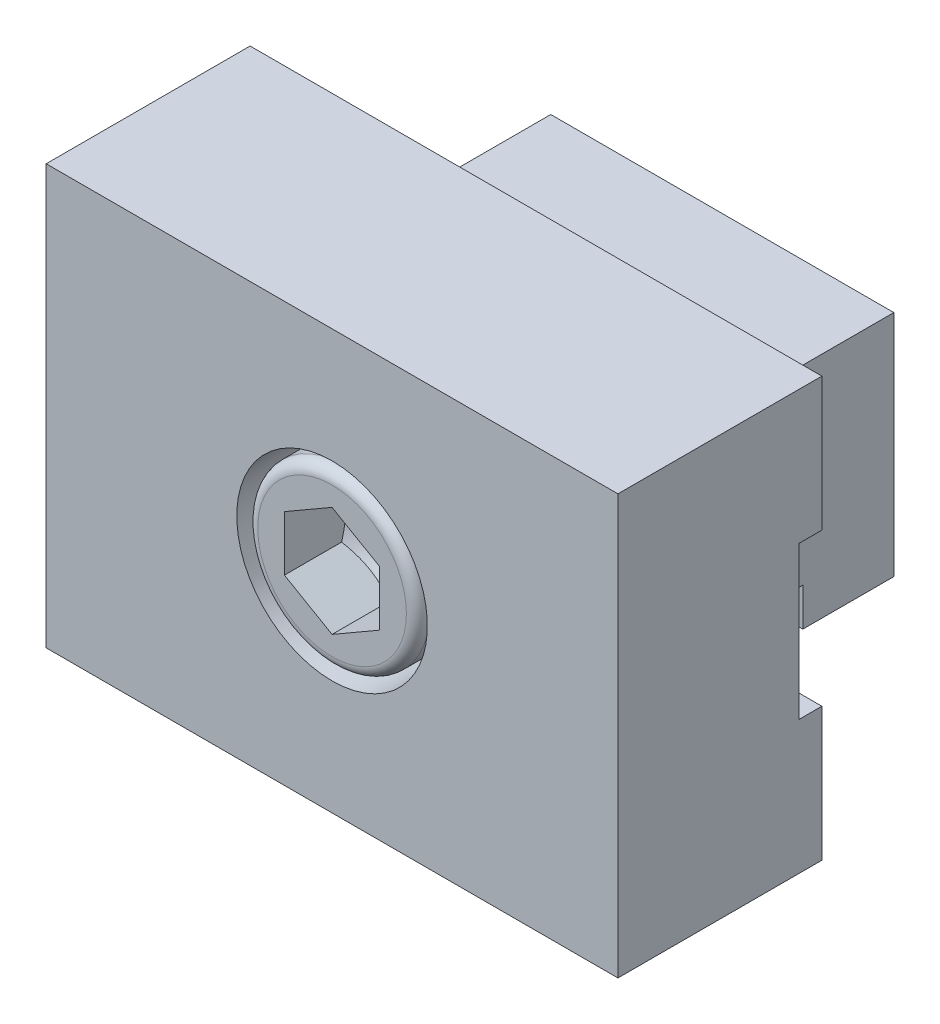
ISO-10303-21;
HEADER;
FILE_DESCRIPTION(('STEP AP214'),'2;1');
FILE_NAME('part.step','',(''),(''),'','','');
FILE_SCHEMA(('AUTOMOTIVE_DESIGN { 1 0 10303 214 1 1 1 1 }'));
ENDSEC;
DATA;
#1=APPLICATION_CONTEXT('core data for automotive mechanical design processes');
#2=APPLICATION_PROTOCOL_DEFINITION('international standard','automotive_design',2000,#1);
#3=PRODUCT_CONTEXT('',#1,'mechanical');
#4=PRODUCT('Part','Part','',(#3));
#5=PRODUCT_RELATED_PRODUCT_CATEGORY('part','',(#4));
#6=PRODUCT_DEFINITION_FORMATION('','',#4);
#7=PRODUCT_DEFINITION_CONTEXT('part definition',#1,'design');
#8=PRODUCT_DEFINITION('design','',#6,#7);
#9=PRODUCT_DEFINITION_SHAPE('','',#8);
#10=(LENGTH_UNIT() NAMED_UNIT(*) SI_UNIT(.MILLI.,.METRE.));
#11=(NAMED_UNIT(*) PLANE_ANGLE_UNIT() SI_UNIT($,.RADIAN.));
#12=(NAMED_UNIT(*) SI_UNIT($,.STERADIAN.) SOLID_ANGLE_UNIT());
#13=UNCERTAINTY_MEASURE_WITH_UNIT(LENGTH_MEASURE(1.E-05),#10,'distance_accuracy_value','');
#14=(GEOMETRIC_REPRESENTATION_CONTEXT(3) GLOBAL_UNCERTAINTY_ASSIGNED_CONTEXT((#13)) GLOBAL_UNIT_ASSIGNED_CONTEXT((#10,
#11,#12)) REPRESENTATION_CONTEXT('',''));
#15=CARTESIAN_POINT('',(0.,0.,0.));
#16=DIRECTION('',(0.,0.,1.));
#17=DIRECTION('',(1.,0.,0.));
#18=AXIS2_PLACEMENT_3D('',#15,#16,#17);
#19=CARTESIAN_POINT('',(0.,0.,-7.7875));
#20=DIRECTION('',(0.,0.,-1.));
#21=DIRECTION('',(-0.5,-0.866025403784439,0.));
#22=AXIS2_PLACEMENT_3D('',#19,#20,#21);
#23=CYLINDRICAL_SURFACE('',#22,6.);
#24=CARTESIAN_POINT('',(0.,0.,2.00000000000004));
#25=DIRECTION('',(0.,0.,1.));
#26=DIRECTION('',(0.,-1.,0.));
#27=AXIS2_PLACEMENT_3D('',#24,#25,#26);
#28=CIRCLE('',#27,6.);
#29=CARTESIAN_POINT('',(0.,-6.,2.00000000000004));
#30=VERTEX_POINT('',#29);
#31=EDGE_CURVE('E410',#30,#30,#28,.T.);
#32=ORIENTED_EDGE('',*,*,#31,.T.);
#33=EDGE_LOOP('',(#32));
#34=FACE_BOUND('',#33,.T.);
#35=CARTESIAN_POINT('',(0.,0.,2.4));
#36=DIRECTION('',(0.,0.,1.));
#37=DIRECTION('',(1.,0.,0.));
#38=AXIS2_PLACEMENT_3D('',#35,#36,#37);
#39=CIRCLE('',#38,6.);
#40=CARTESIAN_POINT('',(6.,0.,2.4));
#41=VERTEX_POINT('',#40);
#42=EDGE_CURVE('E19',#41,#41,#39,.F.);
#43=ORIENTED_EDGE('',*,*,#42,.T.);
#44=EDGE_LOOP('',(#43));
#45=FACE_BOUND('',#44,.T.);
#46=ADVANCED_FACE('F15',(#34,#45),#23,.T.);
#47=CARTESIAN_POINT('',(-18.,8.,-10.));
#48=DIRECTION('',(0.,1.,0.));
#49=DIRECTION('',(0.,0.,1.));
#50=AXIS2_PLACEMENT_3D('',#47,#48,#49);
#51=PLANE('',#50);
#52=DIRECTION('',(0.,0.,-1.));
#53=VECTOR('',#52,1.);
#54=CARTESIAN_POINT('',(-18.,8.,-9.49031612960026));
#55=LINE('',#54,#53);
#56=CARTESIAN_POINT('',(-18.,8.,0.));
#57=VERTEX_POINT('',#56);
#58=CARTESIAN_POINT('',(-18.,8.,-10.));
#59=VERTEX_POINT('',#58);
#60=EDGE_CURVE('E770',#57,#59,#55,.T.);
#61=ORIENTED_EDGE('',*,*,#60,.F.);
#62=DIRECTION('',(1.,0.,0.));
#63=VECTOR('',#62,1.);
#64=CARTESIAN_POINT('',(-20.,8.,0.));
#65=LINE('',#64,#63);
#66=CARTESIAN_POINT('',(18.,8.,0.));
#67=VERTEX_POINT('',#66);
#68=EDGE_CURVE('E26',#57,#67,#65,.T.);
#69=ORIENTED_EDGE('',*,*,#68,.T.);
#70=DIRECTION('',(0.,0.,1.));
#71=VECTOR('',#70,1.);
#72=CARTESIAN_POINT('',(18.,8.,-9.49031612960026));
#73=LINE('',#72,#71);
#74=CARTESIAN_POINT('',(18.,8.,-10.));
#75=VERTEX_POINT('',#74);
#76=EDGE_CURVE('E521',#75,#67,#73,.T.);
#77=ORIENTED_EDGE('',*,*,#76,.F.);
#78=DIRECTION('',(1.,0.,0.));
#79=VECTOR('',#78,1.);
#80=CARTESIAN_POINT('',(-18.,8.,-10.));
#81=LINE('',#80,#79);
#82=EDGE_CURVE('E550',#59,#75,#81,.T.);
#83=ORIENTED_EDGE('',*,*,#82,.F.);
#84=EDGE_LOOP('',(#61,#69,#77,#83));
#85=FACE_BOUND('',#84,.T.);
#86=ADVANCED_FACE('F268',(#85),#51,.T.);
#87=CARTESIAN_POINT('',(-18.,-8.,-10.));
#88=DIRECTION('',(0.,1.,0.));
#89=DIRECTION('',(0.,0.,1.));
#90=AXIS2_PLACEMENT_3D('',#87,#88,#89);
#91=PLANE('',#90);
#92=DIRECTION('',(0.,0.,1.));
#93=VECTOR('',#92,1.);
#94=CARTESIAN_POINT('',(18.,-8.,-9.49031612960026));
#95=LINE('',#94,#93);
#96=CARTESIAN_POINT('',(18.,-8.,0.));
#97=VERTEX_POINT('',#96);
#98=CARTESIAN_POINT('',(18.,-8.,-10.));
#99=VERTEX_POINT('',#98);
#100=EDGE_CURVE('E536',#97,#99,#95,.F.);
#101=ORIENTED_EDGE('',*,*,#100,.F.);
#102=DIRECTION('',(1.,0.,0.));
#103=VECTOR('',#102,1.);
#104=CARTESIAN_POINT('',(-20.,-8.,0.));
#105=LINE('',#104,#103);
#106=CARTESIAN_POINT('',(-18.,-8.,0.));
#107=VERTEX_POINT('',#106);
#108=EDGE_CURVE('E9',#97,#107,#105,.F.);
#109=ORIENTED_EDGE('',*,*,#108,.T.);
#110=DIRECTION('',(0.,0.,-1.));
#111=VECTOR('',#110,1.);
#112=CARTESIAN_POINT('',(-18.,-8.,-9.49031612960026));
#113=LINE('',#112,#111);
#114=CARTESIAN_POINT('',(-18.,-8.,-10.));
#115=VERTEX_POINT('',#114);
#116=EDGE_CURVE('E762',#115,#107,#113,.F.);
#117=ORIENTED_EDGE('',*,*,#116,.F.);
#118=DIRECTION('',(1.,0.,0.));
#119=VECTOR('',#118,1.);
#120=CARTESIAN_POINT('',(-18.,-8.,-10.));
#121=LINE('',#120,#119);
#122=EDGE_CURVE('E554',#99,#115,#121,.F.);
#123=ORIENTED_EDGE('',*,*,#122,.F.);
#124=EDGE_LOOP('',(#101,#109,#117,#123));
#125=FACE_BOUND('',#124,.T.);
#126=ADVANCED_FACE('F274',(#125),#91,.F.);
#127=CARTESIAN_POINT('',(-18.,-12.,-10.));
#128=DIRECTION('',(0.,0.,-1.));
#129=DIRECTION('',(0.,1.,0.));
#130=AXIS2_PLACEMENT_3D('',#127,#128,#129);
#131=PLANE('',#130);
#132=DIRECTION('',(1.,0.,0.));
#133=VECTOR('',#132,1.);
#134=CARTESIAN_POINT('',(-18.,-12.,-10.));
#135=LINE('',#134,#133);
#136=CARTESIAN_POINT('',(-18.,-12.,-10.));
#137=VERTEX_POINT('',#136);
#138=CARTESIAN_POINT('',(18.,-12.,-10.));
#139=VERTEX_POINT('',#138);
#140=EDGE_CURVE('E745',#137,#139,#135,.T.);
#141=ORIENTED_EDGE('',*,*,#140,.T.);
#142=DIRECTION('',(0.,-1.,0.));
#143=VECTOR('',#142,1.);
#144=CARTESIAN_POINT('',(18.,5.28464825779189,-10.));
#145=LINE('',#144,#143);
#146=EDGE_CURVE('E741',#99,#139,#145,.T.);
#147=ORIENTED_EDGE('',*,*,#146,.F.);
#148=ORIENTED_EDGE('',*,*,#122,.T.);
#149=DIRECTION('',(0.,-1.,0.));
#150=VECTOR('',#149,1.);
#151=CARTESIAN_POINT('',(-18.,5.28464825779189,-10.));
#152=LINE('',#151,#150);
#153=EDGE_CURVE('E757',#137,#115,#152,.F.);
#154=ORIENTED_EDGE('',*,*,#153,.F.);
#155=EDGE_LOOP('',(#141,#147,#148,#154));
#156=FACE_BOUND('',#155,.T.);
#157=ADVANCED_FACE('F281',(#156),#131,.F.);
#158=CARTESIAN_POINT('',(-18.,-12.,-19.5499287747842));
#159=DIRECTION('',(0.,1.,0.));
#160=DIRECTION('',(0.,0.,1.));
#161=AXIS2_PLACEMENT_3D('',#158,#159,#160);
#162=PLANE('',#161);
#163=DIRECTION('',(1.,0.,0.));
#164=VECTOR('',#163,1.);
#165=CARTESIAN_POINT('',(-18.,-12.,-19.5499287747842));
#166=LINE('',#165,#164);
#167=CARTESIAN_POINT('',(18.,-12.,-19.5499287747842));
#168=VERTEX_POINT('',#167);
#169=CARTESIAN_POINT('',(-18.,-12.,-19.5499287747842));
#170=VERTEX_POINT('',#169);
#171=EDGE_CURVE('E795',#168,#170,#166,.F.);
#172=ORIENTED_EDGE('',*,*,#171,.F.);
#173=DIRECTION('',(0.,0.,1.));
#174=VECTOR('',#173,1.);
#175=CARTESIAN_POINT('',(18.,-12.,-19.5499287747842));
#176=LINE('',#175,#174);
#177=EDGE_CURVE('E749',#139,#168,#176,.F.);
#178=ORIENTED_EDGE('',*,*,#177,.F.);
#179=ORIENTED_EDGE('',*,*,#140,.F.);
#180=DIRECTION('',(0.,0.,-1.));
#181=VECTOR('',#180,1.);
#182=CARTESIAN_POINT('',(-18.,-12.,-9.49031612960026));
#183=LINE('',#182,#181);
#184=EDGE_CURVE('E753',#170,#137,#183,.F.);
#185=ORIENTED_EDGE('',*,*,#184,.F.);
#186=EDGE_LOOP('',(#172,#178,#179,#185));
#187=FACE_BOUND('',#186,.T.);
#188=ADVANCED_FACE('F827',(#187),#162,.F.);
#189=CARTESIAN_POINT('',(-18.,0.,-19.5499287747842));
#190=DIRECTION('',(0.,0.,-1.));
#191=DIRECTION('',(0.,1.,0.));
#192=AXIS2_PLACEMENT_3D('',#189,#190,#191);
#193=PLANE('',#192);
#194=CARTESIAN_POINT('',(0.,0.,-19.5499287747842));
#195=DIRECTION('',(0.,0.,1.));
#196=DIRECTION('',(0.,-1.,0.));
#197=AXIS2_PLACEMENT_3D('',#194,#195,#196);
#198=CIRCLE('',#197,6.);
#199=CARTESIAN_POINT('',(0.,-6.,-19.5499287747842));
#200=VERTEX_POINT('',#199);
#201=EDGE_CURVE('E558',#200,#200,#198,.T.);
#202=ORIENTED_EDGE('',*,*,#201,.T.);
#203=EDGE_LOOP('',(#202));
#204=FACE_BOUND('',#203,.T.);
#205=DIRECTION('',(0.,1.,0.));
#206=VECTOR('',#205,1.);
#207=CARTESIAN_POINT('',(-18.,0.,-19.5499287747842));
#208=LINE('',#207,#206);
#209=CARTESIAN_POINT('',(-18.,12.,-19.5499287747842));
#210=VERTEX_POINT('',#209);
#211=EDGE_CURVE('E799',#170,#210,#208,.T.);
#212=ORIENTED_EDGE('',*,*,#211,.T.);
#213=DIRECTION('',(1.,0.,0.));
#214=VECTOR('',#213,1.);
#215=CARTESIAN_POINT('',(-18.,12.,-19.5499287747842));
#216=LINE('',#215,#214);
#217=CARTESIAN_POINT('',(18.,12.,-19.5499287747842));
#218=VERTEX_POINT('',#217);
#219=EDGE_CURVE('E562',#210,#218,#216,.T.);
#220=ORIENTED_EDGE('',*,*,#219,.T.);
#221=DIRECTION('',(0.,1.,0.));
#222=VECTOR('',#221,1.);
#223=CARTESIAN_POINT('',(18.,0.,-19.5499287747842));
#224=LINE('',#223,#222);
#225=EDGE_CURVE('E791',#218,#168,#224,.F.);
#226=ORIENTED_EDGE('',*,*,#225,.T.);
#227=ORIENTED_EDGE('',*,*,#171,.T.);
#228=EDGE_LOOP('',(#212,#220,#226,#227));
#229=FACE_BOUND('',#228,.T.);
#230=ADVANCED_FACE('F812',(#204,#229),#193,.T.);
#231=CARTESIAN_POINT('',(0.,0.,-19.5499287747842));
#232=DIRECTION('',(0.,0.,1.));
#233=DIRECTION('',(0.,-1.,0.));
#234=AXIS2_PLACEMENT_3D('',#231,#232,#233);
#235=CYLINDRICAL_SURFACE('',#234,6.);
#236=CARTESIAN_POINT('',(0.,0.,-19.5264625));
#237=DIRECTION('',(0.,0.,-1.));
#238=DIRECTION('',(-0.5,-0.866025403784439,0.));
#239=AXIS2_PLACEMENT_3D('',#236,#237,#238);
#240=CIRCLE('',#239,6.);
#241=CARTESIAN_POINT('',(-3.,-5.19615242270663,-19.5264625));
#242=VERTEX_POINT('',#241);
#243=EDGE_CURVE('E559',#242,#242,#240,.F.);
#244=ORIENTED_EDGE('',*,*,#243,.T.);
#245=EDGE_LOOP('',(#244));
#246=FACE_BOUND('',#245,.T.);
#247=ORIENTED_EDGE('',*,*,#201,.F.);
#248=EDGE_LOOP('',(#247));
#249=FACE_BOUND('',#248,.T.);
#250=ADVANCED_FACE('F815',(#246,#249),#235,.F.);
#251=CARTESIAN_POINT('',(-18.,12.,-19.5499287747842));
#252=DIRECTION('',(0.,1.,0.));
#253=DIRECTION('',(0.,0.,1.));
#254=AXIS2_PLACEMENT_3D('',#251,#252,#253);
#255=PLANE('',#254);
#256=DIRECTION('',(0.,0.,1.));
#257=VECTOR('',#256,1.);
#258=CARTESIAN_POINT('',(18.,12.,-19.5499287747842));
#259=LINE('',#258,#257);
#260=CARTESIAN_POINT('',(18.,12.,-10.));
#261=VERTEX_POINT('',#260);
#262=EDGE_CURVE('E787',#261,#218,#259,.F.);
#263=ORIENTED_EDGE('',*,*,#262,.T.);
#264=ORIENTED_EDGE('',*,*,#219,.F.);
#265=DIRECTION('',(0.,0.,1.));
#266=VECTOR('',#265,1.);
#267=CARTESIAN_POINT('',(-18.,12.,-19.5499287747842));
#268=LINE('',#267,#266);
#269=CARTESIAN_POINT('',(-18.,12.,-10.));
#270=VERTEX_POINT('',#269);
#271=EDGE_CURVE('E779',#210,#270,#268,.T.);
#272=ORIENTED_EDGE('',*,*,#271,.T.);
#273=DIRECTION('',(1.,0.,0.));
#274=VECTOR('',#273,1.);
#275=CARTESIAN_POINT('',(-18.,12.,-10.));
#276=LINE('',#275,#274);
#277=EDGE_CURVE('E783',#270,#261,#276,.T.);
#278=ORIENTED_EDGE('',*,*,#277,.T.);
#279=EDGE_LOOP('',(#263,#264,#272,#278));
#280=FACE_BOUND('',#279,.T.);
#281=ADVANCED_FACE('F817',(#280),#255,.T.);
#282=CARTESIAN_POINT('',(-18.,12.,-10.));
#283=DIRECTION('',(0.,0.,1.));
#284=DIRECTION('',(0.,-1.,0.));
#285=AXIS2_PLACEMENT_3D('',#282,#283,#284);
#286=PLANE('',#285);
#287=DIRECTION('',(0.,-1.,0.));
#288=VECTOR('',#287,1.);
#289=CARTESIAN_POINT('',(18.,5.28464825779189,-10.));
#290=LINE('',#289,#288);
#291=EDGE_CURVE('E529',#261,#75,#290,.T.);
#292=ORIENTED_EDGE('',*,*,#291,.F.);
#293=ORIENTED_EDGE('',*,*,#277,.F.);
#294=DIRECTION('',(0.,-1.,0.));
#295=VECTOR('',#294,1.);
#296=CARTESIAN_POINT('',(-18.,5.28464825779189,-10.));
#297=LINE('',#296,#295);
#298=EDGE_CURVE('E775',#59,#270,#297,.F.);
#299=ORIENTED_EDGE('',*,*,#298,.F.);
#300=ORIENTED_EDGE('',*,*,#82,.T.);
#301=EDGE_LOOP('',(#292,#293,#299,#300));
#302=FACE_BOUND('',#301,.T.);
#303=ADVANCED_FACE('F824',(#302),#286,.T.);
#304=CARTESIAN_POINT('',(18.,5.28464825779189,-9.49031612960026));
#305=DIRECTION('',(1.,0.,0.));
#306=DIRECTION('',(0.,0.,1.));
#307=AXIS2_PLACEMENT_3D('',#304,#305,#306);
#308=PLANE('',#307);
#309=ORIENTED_EDGE('',*,*,#146,.T.);
#310=ORIENTED_EDGE('',*,*,#177,.T.);
#311=ORIENTED_EDGE('',*,*,#225,.F.);
#312=ORIENTED_EDGE('',*,*,#262,.F.);
#313=ORIENTED_EDGE('',*,*,#291,.T.);
#314=ORIENTED_EDGE('',*,*,#76,.T.);
#315=CARTESIAN_POINT('',(18.,8.,2.00000000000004));
#316=VERTEX_POINT('',#315);
#317=EDGE_CURVE('E525',#67,#316,#73,.T.);
#318=ORIENTED_EDGE('',*,*,#317,.T.);
#319=DIRECTION('',(0.,-1.,0.));
#320=VECTOR('',#319,1.);
#321=CARTESIAN_POINT('',(18.,5.28464825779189,2.00000000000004));
#322=LINE('',#321,#320);
#323=CARTESIAN_POINT('',(18.,-8.,2.00000000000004));
#324=VERTEX_POINT('',#323);
#325=EDGE_CURVE('E532',#316,#324,#322,.T.);
#326=ORIENTED_EDGE('',*,*,#325,.T.);
#327=EDGE_CURVE('E37',#324,#97,#95,.F.);
#328=ORIENTED_EDGE('',*,*,#327,.T.);
#329=ORIENTED_EDGE('',*,*,#100,.T.);
#330=EDGE_LOOP('',(#309,#310,#311,#312,#313,#314,#318,#326,#328,#329));
#331=FACE_BOUND('',#330,.T.);
#332=ADVANCED_FACE('F523',(#331),#308,.T.);
#333=CARTESIAN_POINT('',(-18.,5.28464825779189,-9.49031612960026));
#334=DIRECTION('',(-1.,0.,0.));
#335=DIRECTION('',(0.,0.,-1.));
#336=AXIS2_PLACEMENT_3D('',#333,#334,#335);
#337=PLANE('',#336);
#338=ORIENTED_EDGE('',*,*,#298,.T.);
#339=ORIENTED_EDGE('',*,*,#271,.F.);
#340=ORIENTED_EDGE('',*,*,#211,.F.);
#341=ORIENTED_EDGE('',*,*,#184,.T.);
#342=ORIENTED_EDGE('',*,*,#153,.T.);
#343=ORIENTED_EDGE('',*,*,#116,.T.);
#344=CARTESIAN_POINT('',(-18.,-8.,2.00000000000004));
#345=VERTEX_POINT('',#344);
#346=EDGE_CURVE('E761',#107,#345,#113,.F.);
#347=ORIENTED_EDGE('',*,*,#346,.T.);
#348=DIRECTION('',(0.,-1.,0.));
#349=VECTOR('',#348,1.);
#350=CARTESIAN_POINT('',(-18.,5.28464825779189,2.00000000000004));
#351=LINE('',#350,#349);
#352=CARTESIAN_POINT('',(-18.,8.,2.00000000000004));
#353=VERTEX_POINT('',#352);
#354=EDGE_CURVE('E766',#345,#353,#351,.F.);
#355=ORIENTED_EDGE('',*,*,#354,.T.);
#356=EDGE_CURVE('E771',#353,#57,#55,.T.);
#357=ORIENTED_EDGE('',*,*,#356,.T.);
#358=ORIENTED_EDGE('',*,*,#60,.T.);
#359=EDGE_LOOP('',(#338,#339,#340,#341,#342,#343,#347,#355,#357,#358));
#360=FACE_BOUND('',#359,.T.);
#361=ADVANCED_FACE('F830',(#360),#337,.T.);
#362=CARTESIAN_POINT('',(-18.,8.,2.00000000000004));
#363=DIRECTION('',(0.,0.,1.));
#364=DIRECTION('',(0.,-1.,0.));
#365=AXIS2_PLACEMENT_3D('',#362,#363,#364);
#366=PLANE('',#365);
#367=ORIENTED_EDGE('',*,*,#31,.F.);
#368=EDGE_LOOP('',(#367));
#369=FACE_BOUND('',#368,.T.);
#370=ORIENTED_EDGE('',*,*,#354,.F.);
#371=DIRECTION('',(1.,0.,0.));
#372=VECTOR('',#371,1.);
#373=CARTESIAN_POINT('',(-18.,-8.,2.00000000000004));
#374=LINE('',#373,#372);
#375=EDGE_CURVE('E542',#345,#324,#374,.T.);
#376=ORIENTED_EDGE('',*,*,#375,.T.);
#377=ORIENTED_EDGE('',*,*,#325,.F.);
#378=DIRECTION('',(1.,0.,0.));
#379=VECTOR('',#378,1.);
#380=CARTESIAN_POINT('',(-18.,8.,2.00000000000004));
#381=LINE('',#380,#379);
#382=EDGE_CURVE('E546',#316,#353,#381,.F.);
#383=ORIENTED_EDGE('',*,*,#382,.T.);
#384=EDGE_LOOP('',(#370,#376,#377,#383));
#385=FACE_BOUND('',#384,.T.);
#386=ADVANCED_FACE('F291',(#369,#385),#366,.T.);
#387=CARTESIAN_POINT('',(-1.5,-2.59807621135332,-20.6));
#388=DIRECTION('',(0.,0.,-1.));
#389=DIRECTION('',(-0.5,-0.866025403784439,0.));
#390=AXIS2_PLACEMENT_3D('',#387,#388,#389);
#391=PLANE('',#390);
#392=CARTESIAN_POINT('',(0.,0.,-20.6000000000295));
#393=DIRECTION('',(0.,0.,1.));
#394=DIRECTION('',(-0.866025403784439,0.5,0.));
#395=AXIS2_PLACEMENT_3D('',#392,#393,#394);
#396=CIRCLE('',#395,4.92646249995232);
#397=CARTESIAN_POINT('',(-4.2664416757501,2.46323124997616,-20.6000000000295));
#398=VERTEX_POINT('',#397);
#399=EDGE_CURVE('E406',#398,#398,#396,.T.);
#400=ORIENTED_EDGE('',*,*,#399,.F.);
#401=EDGE_LOOP('',(#400));
#402=FACE_BOUND('',#401,.T.);
#403=ADVANCED_FACE('F287',(#402),#391,.T.);
#404=CARTESIAN_POINT('',(0.,0.,-19.5264625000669));
#405=DIRECTION('',(0.,0.,1.));
#406=DIRECTION('',(-0.866025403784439,0.5,0.));
#407=AXIS2_PLACEMENT_3D('',#404,#405,#406);
#408=CONICAL_SURFACE('',#407,5.99999999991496,0.785398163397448);
#409=ORIENTED_EDGE('',*,*,#399,.T.);
#410=EDGE_LOOP('',(#409));
#411=FACE_BOUND('',#410,.T.);
#412=ORIENTED_EDGE('',*,*,#243,.F.);
#413=EDGE_LOOP('',(#412));
#414=FACE_BOUND('',#413,.T.);
#415=ADVANCED_FACE('F283',(#411,#414),#408,.T.);
#416=CARTESIAN_POINT('',(0.,0.,15.4199999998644));
#417=DIRECTION('',(0.,0.,1.));
#418=DIRECTION('',(-0.866025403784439,0.5,0.));
#419=AXIS2_PLACEMENT_3D('',#416,#417,#418);
#420=CONICAL_SURFACE('',#419,5.80814370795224,1.04719755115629);
#421=CARTESIAN_POINT('',(5.6847755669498E-11,9.84581340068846E-11,12.0666666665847));
#422=VERTEX_POINT('',#421);
#423=VERTEX_LOOP('',#422);
#424=FACE_BOUND('',#423,.T.);
#425=CARTESIAN_POINT('',(-5.00000000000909,-2.88675134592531,15.3999999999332));
#426=CARTESIAN_POINT('',(-4.78026878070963,-3.01361322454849,15.3267433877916));
#427=CARTESIAN_POINT('',(-4.55865818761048,-3.14156016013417,15.2601139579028));
#428=CARTESIAN_POINT('',(-4.1115999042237,-3.39966938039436,15.1438136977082));
#429=CARTESIAN_POINT('',(-3.8861442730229,-3.5298362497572,15.0941840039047));
#430=CARTESIAN_POINT('',(-3.43799264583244,-3.78857671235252,15.0169443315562));
#431=CARTESIAN_POINT('',(-3.21536642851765,-3.91711001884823,14.9888198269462));
#432=CARTESIAN_POINT('',(-2.88064429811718,-4.11036193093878,14.9636032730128));
#433=CARTESIAN_POINT('',(-2.76899393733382,-4.17482329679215,14.9580247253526));
#434=CARTESIAN_POINT('',(-2.54559014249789,-4.30380553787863,14.9526191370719));
#435=CARTESIAN_POINT('',(-2.43383671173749,-4.36832641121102,14.9527919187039));
#436=CARTESIAN_POINT('',(-2.12768962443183,-4.54508051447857,14.9611797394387));
#437=CARTESIAN_POINT('',(-1.93339749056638,-4.65725513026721,14.975256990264));
#438=CARTESIAN_POINT('',(-1.54610267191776,-4.88085989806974,15.0198894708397));
#439=CARTESIAN_POINT('',(-1.35310134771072,-4.99228926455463,15.0504599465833));
#440=CARTESIAN_POINT('',(-0.965026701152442,-5.21634426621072,15.1268756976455));
#441=CARTESIAN_POINT('',(-0.770002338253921,-5.32894163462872,15.1730446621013));
#442=CARTESIAN_POINT('',(-0.382861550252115,-5.55245747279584,15.2778288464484));
#443=CARTESIAN_POINT('',(-0.190740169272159,-5.6633788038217,15.3364194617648));
#444=CARTESIAN_POINT('',(1.6907482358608E-11,-5.77350269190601,15.3999999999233));
#445=B_SPLINE_CURVE_WITH_KNOTS('',3,(#425,#426,#427,#428,#429,#430,#431,#432,#433,#434,#435,
#436,#437,#438,#439,#440,#441,#442,#443,#444),.UNSPECIFIED.,.F.,.F.,(4,2,2,2,2,2,2,2,2,4),(0.,
0.792540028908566,1.58698454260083,2.36176901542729,2.74878733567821,3.13579369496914,
3.80946092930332,4.48375195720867,5.17299552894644,5.86088640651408),.UNSPECIFIED.);
#446=CARTESIAN_POINT('',(-5.00000000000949,-2.88675134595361,15.399999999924));
#447=VERTEX_POINT('',#446);
#448=CARTESIAN_POINT('',(9.50368256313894E-12,-5.77350269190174,15.3999999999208));
#449=VERTEX_POINT('',#448);
#450=EDGE_CURVE('E178',#447,#449,#445,.T.);
#451=ORIENTED_EDGE('',*,*,#450,.T.);
#452=CARTESIAN_POINT('',(-2.43004401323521E-11,-5.77350269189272,15.3999999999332));
#453=CARTESIAN_POINT('',(0.219731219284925,-5.64664081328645,15.3267433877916));
#454=CARTESIAN_POINT('',(0.441341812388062,-5.51869387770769,15.2601139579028));
#455=CARTESIAN_POINT('',(0.888400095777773,-5.26058465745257,15.1438136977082));
#456=CARTESIAN_POINT('',(1.11385572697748,-5.13041778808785,15.0941840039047));
#457=CARTESIAN_POINT('',(1.56200735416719,-4.87167732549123,15.0169443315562));
#458=CARTESIAN_POINT('',(1.78463357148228,-4.74314401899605,14.9888198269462));
#459=CARTESIAN_POINT('',(2.11935570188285,-4.54989210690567,14.9636032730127));
#460=CARTESIAN_POINT('',(2.23100606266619,-4.48543074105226,14.9580247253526));
#461=CARTESIAN_POINT('',(2.4544098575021,-4.35644849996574,14.9526191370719));
#462=CARTESIAN_POINT('',(2.56616328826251,-4.29192762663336,14.9527919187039));
#463=CARTESIAN_POINT('',(2.87231037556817,-4.11517352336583,14.9611797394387));
#464=CARTESIAN_POINT('',(3.06660250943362,-4.00299890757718,14.975256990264));
#465=CARTESIAN_POINT('',(3.45389732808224,-3.77939413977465,15.0198894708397));
#466=CARTESIAN_POINT('',(3.64689865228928,-3.66796477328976,15.0504599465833));
#467=CARTESIAN_POINT('',(4.03497329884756,-3.44390977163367,15.1268756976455));
#468=CARTESIAN_POINT('',(4.22999766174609,-3.33131240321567,15.1730446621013));
#469=CARTESIAN_POINT('',(4.61713844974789,-3.10779656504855,15.2778288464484));
#470=CARTESIAN_POINT('',(4.80925983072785,-2.99687523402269,15.3364194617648));
#471=CARTESIAN_POINT('',(5.00000000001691,-2.88675134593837,15.3999999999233));
#472=B_SPLINE_CURVE_WITH_KNOTS('',3,(#452,#453,#454,#455,#456,#457,#458,#459,#460,#461,#462,
#463,#464,#465,#466,#467,#468,#469,#470,#471),.UNSPECIFIED.,.F.,.F.,(4,2,2,2,2,2,2,2,2,4),(0.,
0.792540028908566,1.58698454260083,2.36176901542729,2.74878733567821,3.13579369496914,
3.80946092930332,4.48375195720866,5.17299552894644,5.86088640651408),.UNSPECIFIED.);
#473=CARTESIAN_POINT('',(5.0000000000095,-2.88675134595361,15.399999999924));
#474=VERTEX_POINT('',#473);
#475=EDGE_CURVE('E338',#449,#474,#472,.T.);
#476=ORIENTED_EDGE('',*,*,#475,.T.);
#477=CARTESIAN_POINT('',(4.99999999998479,-2.88675134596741,15.3999999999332));
#478=CARTESIAN_POINT('',(4.99999999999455,-2.63302758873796,15.3267433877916));
#479=CARTESIAN_POINT('',(4.99999999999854,-2.37713371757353,15.2601139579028));
#480=CARTESIAN_POINT('',(5.00000000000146,-1.86091527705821,15.1438136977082));
#481=CARTESIAN_POINT('',(5.00000000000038,-1.60058153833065,15.0941840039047));
#482=CARTESIAN_POINT('',(4.99999999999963,-1.08310061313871,15.0169443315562));
#483=CARTESIAN_POINT('',(4.99999999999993,-0.826034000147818,14.9888198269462));
#484=CARTESIAN_POINT('',(5.00000000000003,-0.439530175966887,14.9636032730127));
#485=CARTESIAN_POINT('',(5.00000000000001,-0.310607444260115,14.9580247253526));
#486=CARTESIAN_POINT('',(4.99999999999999,-0.0526429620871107,14.9526191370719));
#487=CARTESIAN_POINT('',(5.,0.0763987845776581,14.9527919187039));
#488=CARTESIAN_POINT('',(5.00000000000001,0.429906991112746,14.9611797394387));
#489=CARTESIAN_POINT('',(5.,0.654256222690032,14.975256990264));
#490=CARTESIAN_POINT('',(5.,1.10146575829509,15.0198894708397));
#491=CARTESIAN_POINT('',(5.,1.32432449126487,15.0504599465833));
#492=CARTESIAN_POINT('',(5.,1.77243449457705,15.1268756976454));
#493=CARTESIAN_POINT('',(5.,1.99762923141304,15.1730446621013));
#494=CARTESIAN_POINT('',(5.,2.4446609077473,15.2778288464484));
#495=CARTESIAN_POINT('',(5.,2.66650356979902,15.3364194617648));
#496=CARTESIAN_POINT('',(5.,2.88675134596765,15.3999999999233));
#497=B_SPLINE_CURVE_WITH_KNOTS('',3,(#477,#478,#479,#480,#481,#482,#483,#484,#485,#486,#487,
#488,#489,#490,#491,#492,#493,#494,#495,#496),.UNSPECIFIED.,.F.,.F.,(4,2,2,2,2,2,2,2,2,4),(0.,
0.792540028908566,1.58698454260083,2.36176901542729,2.74878733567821,3.13579369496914,
3.80946092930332,4.48375195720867,5.17299552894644,5.86088640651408),.UNSPECIFIED.);
#498=CARTESIAN_POINT('',(5.00000000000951,2.88675134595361,15.399999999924));
#499=VERTEX_POINT('',#498);
#500=EDGE_CURVE('E344',#474,#499,#497,.T.);
#501=ORIENTED_EDGE('',*,*,#500,.T.);
#502=CARTESIAN_POINT('',(5.0000000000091,2.88675134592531,15.3999999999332));
#503=CARTESIAN_POINT('',(4.78026878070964,3.01361322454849,15.3267433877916));
#504=CARTESIAN_POINT('',(4.55865818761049,3.14156016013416,15.2601139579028));
#505=CARTESIAN_POINT('',(4.1115999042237,3.39966938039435,15.1438136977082));
#506=CARTESIAN_POINT('',(3.88614427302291,3.52983624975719,15.0941840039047));
#507=CARTESIAN_POINT('',(3.43799264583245,3.78857671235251,15.0169443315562));
#508=CARTESIAN_POINT('',(3.21536642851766,3.91711001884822,14.9888198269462));
#509=CARTESIAN_POINT('',(2.88064429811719,4.11036193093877,14.9636032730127));
#510=CARTESIAN_POINT('',(2.76899393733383,4.17482329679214,14.9580247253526));
#511=CARTESIAN_POINT('',(2.5455901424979,4.30380553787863,14.9526191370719));
#512=CARTESIAN_POINT('',(2.4338367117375,4.36832641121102,14.9527919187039));
#513=CARTESIAN_POINT('',(2.12768962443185,4.54508051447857,14.9611797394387));
#514=CARTESIAN_POINT('',(1.93339749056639,4.65725513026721,14.975256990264));
#515=CARTESIAN_POINT('',(1.54610267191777,4.88085989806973,15.0198894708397));
#516=CARTESIAN_POINT('',(1.35310134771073,4.99228926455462,15.0504599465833));
#517=CARTESIAN_POINT('',(0.96502670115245,5.21634426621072,15.1268756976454));
#518=CARTESIAN_POINT('',(0.770002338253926,5.32894163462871,15.1730446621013));
#519=CARTESIAN_POINT('',(0.38286155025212,5.55245747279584,15.2778288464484));
#520=CARTESIAN_POINT('',(0.190740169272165,5.6633788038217,15.3364194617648));
#521=CARTESIAN_POINT('',(-1.68949056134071E-11,5.77350269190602,15.3999999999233));
#522=B_SPLINE_CURVE_WITH_KNOTS('',3,(#502,#503,#504,#505,#506,#507,#508,#509,#510,#511,#512,
#513,#514,#515,#516,#517,#518,#519,#520,#521),.UNSPECIFIED.,.F.,.F.,(4,2,2,2,2,2,2,2,2,4),(0.,
0.792540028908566,1.58698454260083,2.36176901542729,2.74878733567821,3.13579369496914,
3.80946092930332,4.48375195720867,5.17299552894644,5.86088640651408),.UNSPECIFIED.);
#523=CARTESIAN_POINT('',(0.,5.77350269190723,15.399999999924));
#524=VERTEX_POINT('',#523);
#525=EDGE_CURVE('E350',#499,#524,#522,.T.);
#526=ORIENTED_EDGE('',*,*,#525,.T.);
#527=CARTESIAN_POINT('',(2.430998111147E-11,5.77350269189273,15.3999999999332));
#528=CARTESIAN_POINT('',(-0.219731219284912,5.64664081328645,15.3267433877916));
#529=CARTESIAN_POINT('',(-0.441341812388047,5.51869387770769,15.2601139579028));
#530=CARTESIAN_POINT('',(-0.888400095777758,5.26058465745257,15.1438136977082));
#531=CARTESIAN_POINT('',(-1.11385572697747,5.13041778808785,15.0941840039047));
#532=CARTESIAN_POINT('',(-1.56200735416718,4.87167732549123,15.0169443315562));
#533=CARTESIAN_POINT('',(-1.78463357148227,4.74314401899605,14.9888198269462));
#534=CARTESIAN_POINT('',(-2.11935570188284,4.54989210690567,14.9636032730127));
#535=CARTESIAN_POINT('',(-2.23100606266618,4.48543074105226,14.9580247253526));
#536=CARTESIAN_POINT('',(-2.45440985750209,4.35644849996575,14.9526191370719));
#537=CARTESIAN_POINT('',(-2.5661632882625,4.29192762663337,14.9527919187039));
#538=CARTESIAN_POINT('',(-2.87231037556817,4.11517352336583,14.9611797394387));
#539=CARTESIAN_POINT('',(-3.06660250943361,4.00299890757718,14.975256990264));
#540=CARTESIAN_POINT('',(-3.45389732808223,3.77939413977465,15.0198894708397));
#541=CARTESIAN_POINT('',(-3.64689865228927,3.66796477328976,15.0504599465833));
#542=CARTESIAN_POINT('',(-4.03497329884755,3.44390977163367,15.1268756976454));
#543=CARTESIAN_POINT('',(-4.22999766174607,3.33131240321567,15.1730446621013));
#544=CARTESIAN_POINT('',(-4.61713844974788,3.10779656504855,15.2778288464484));
#545=CARTESIAN_POINT('',(-4.80925983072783,2.99687523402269,15.3364194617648));
#546=CARTESIAN_POINT('',(-5.0000000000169,2.88675134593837,15.3999999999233));
#547=B_SPLINE_CURVE_WITH_KNOTS('',3,(#527,#528,#529,#530,#531,#532,#533,#534,#535,#536,#537,
#538,#539,#540,#541,#542,#543,#544,#545,#546),.UNSPECIFIED.,.F.,.F.,(4,2,2,2,2,2,2,2,2,4),(0.,
0.792540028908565,1.58698454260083,2.36176901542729,2.74878733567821,3.13579369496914,
3.80946092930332,4.48375195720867,5.17299552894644,5.86088640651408),.UNSPECIFIED.);
#548=CARTESIAN_POINT('',(-5.00000000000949,2.88675134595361,15.399999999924));
#549=VERTEX_POINT('',#548);
#550=EDGE_CURVE('E356',#524,#549,#547,.T.);
#551=ORIENTED_EDGE('',*,*,#550,.T.);
#552=CARTESIAN_POINT('',(-4.99999999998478,2.88675134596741,15.3999999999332));
#553=CARTESIAN_POINT('',(-4.99999999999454,2.63302758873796,15.3267433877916));
#554=CARTESIAN_POINT('',(-4.99999999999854,2.37713371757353,15.2601139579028));
#555=CARTESIAN_POINT('',(-5.00000000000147,1.86091527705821,15.1438136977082));
#556=CARTESIAN_POINT('',(-5.00000000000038,1.60058153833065,15.0941840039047));
#557=CARTESIAN_POINT('',(-4.99999999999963,1.08310061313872,15.0169443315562));
#558=CARTESIAN_POINT('',(-4.99999999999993,0.826034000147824,14.9888198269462));
#559=CARTESIAN_POINT('',(-5.00000000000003,0.439530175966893,14.9636032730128));
#560=CARTESIAN_POINT('',(-5.00000000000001,0.310607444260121,14.9580247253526));
#561=CARTESIAN_POINT('',(-4.99999999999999,0.0526429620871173,14.9526191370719));
#562=CARTESIAN_POINT('',(-5.,-0.076398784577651,14.9527919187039));
#563=CARTESIAN_POINT('',(-5.00000000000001,-0.429906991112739,14.9611797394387));
#564=CARTESIAN_POINT('',(-5.,-0.654256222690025,14.975256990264));
#565=CARTESIAN_POINT('',(-5.,-1.10146575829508,15.0198894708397));
#566=CARTESIAN_POINT('',(-5.,-1.32432449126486,15.0504599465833));
#567=CARTESIAN_POINT('',(-5.,-1.77243449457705,15.1268756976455));
#568=CARTESIAN_POINT('',(-5.,-1.99762923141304,15.1730446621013));
#569=CARTESIAN_POINT('',(-5.,-2.44466090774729,15.2778288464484));
#570=CARTESIAN_POINT('',(-5.,-2.66650356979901,15.3364194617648));
#571=CARTESIAN_POINT('',(-5.,-2.88675134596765,15.3999999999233));
#572=B_SPLINE_CURVE_WITH_KNOTS('',3,(#552,#553,#554,#555,#556,#557,#558,#559,#560,#561,#562,
#563,#564,#565,#566,#567,#568,#569,#570,#571),.UNSPECIFIED.,.F.,.F.,(4,2,2,2,2,2,2,2,2,4),(0.,
0.792540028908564,1.58698454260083,2.36176901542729,2.74878733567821,3.13579369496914,
3.80946092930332,4.48375195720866,5.17299552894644,5.86088640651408),.UNSPECIFIED.);
#573=EDGE_CURVE('E362',#549,#447,#572,.T.);
#574=ORIENTED_EDGE('',*,*,#573,.T.);
#575=EDGE_LOOP('',(#451,#476,#501,#526,#551,#574));
#576=FACE_BOUND('',#575,.T.);
#577=ADVANCED_FACE('F286',(#424,#576),#420,.F.);
#578=CARTESIAN_POINT('',(5.,2.88675134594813,21.4));
#579=DIRECTION('',(0.5,0.866025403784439,0.));
#580=DIRECTION('',(0.866025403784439,-0.5,0.));
#581=AXIS2_PLACEMENT_3D('',#578,#579,#580);
#582=PLANE('',#581);
#583=DIRECTION('',(0.,0.,-1.));
#584=VECTOR('',#583,1.);
#585=CARTESIAN_POINT('',(5.,2.88675134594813,21.4));
#586=LINE('',#585,#584);
#587=CARTESIAN_POINT('',(5.,2.88675134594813,21.4));
#588=VERTEX_POINT('',#587);
#589=EDGE_CURVE('E347',#499,#588,#586,.F.);
#590=ORIENTED_EDGE('',*,*,#589,.T.);
#591=DIRECTION('',(-0.866025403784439,0.5,0.));
#592=VECTOR('',#591,1.);
#593=CARTESIAN_POINT('',(2.5,4.3301270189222,21.4));
#594=LINE('',#593,#592);
#595=CARTESIAN_POINT('',(0.,5.77350269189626,21.4));
#596=VERTEX_POINT('',#595);
#597=EDGE_CURVE('E387',#596,#588,#594,.F.);
#598=ORIENTED_EDGE('',*,*,#597,.F.);
#599=DIRECTION('',(0.,0.,-1.));
#600=VECTOR('',#599,1.);
#601=CARTESIAN_POINT('',(0.,5.77350269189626,21.4));
#602=LINE('',#601,#600);
#603=EDGE_CURVE('E353',#524,#596,#602,.F.);
#604=ORIENTED_EDGE('',*,*,#603,.F.);
#605=ORIENTED_EDGE('',*,*,#525,.F.);
#606=EDGE_LOOP('',(#590,#598,#604,#605));
#607=FACE_BOUND('',#606,.T.);
#608=ADVANCED_FACE('F436',(#607),#582,.F.);
#609=CARTESIAN_POINT('',(0.,5.77350269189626,21.4));
#610=DIRECTION('',(-0.5,0.866025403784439,0.));
#611=DIRECTION('',(0.866025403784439,0.5,0.));
#612=AXIS2_PLACEMENT_3D('',#609,#610,#611);
#613=PLANE('',#612);
#614=ORIENTED_EDGE('',*,*,#603,.T.);
#615=DIRECTION('',(0.866025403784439,0.5,0.));
#616=VECTOR('',#615,1.);
#617=CARTESIAN_POINT('',(-5.,2.88675134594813,21.4));
#618=LINE('',#617,#616);
#619=CARTESIAN_POINT('',(-5.,2.88675134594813,21.4));
#620=VERTEX_POINT('',#619);
#621=EDGE_CURVE('E393',#620,#596,#618,.T.);
#622=ORIENTED_EDGE('',*,*,#621,.F.);
#623=DIRECTION('',(0.,0.,-1.));
#624=VECTOR('',#623,1.);
#625=CARTESIAN_POINT('',(-5.,2.88675134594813,21.4));
#626=LINE('',#625,#624);
#627=EDGE_CURVE('E359',#549,#620,#626,.F.);
#628=ORIENTED_EDGE('',*,*,#627,.F.);
#629=ORIENTED_EDGE('',*,*,#550,.F.);
#630=EDGE_LOOP('',(#614,#622,#628,#629));
#631=FACE_BOUND('',#630,.T.);
#632=ADVANCED_FACE('F465',(#631),#613,.F.);
#633=CARTESIAN_POINT('',(-5.,2.88675134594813,21.4));
#634=DIRECTION('',(-1.,0.,0.));
#635=DIRECTION('',(0.,1.,0.));
#636=AXIS2_PLACEMENT_3D('',#633,#634,#635);
#637=PLANE('',#636);
#638=ORIENTED_EDGE('',*,*,#627,.T.);
#639=DIRECTION('',(0.,1.,0.));
#640=VECTOR('',#639,1.);
#641=CARTESIAN_POINT('',(-5.,-2.88675134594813,21.4));
#642=LINE('',#641,#640);
#643=CARTESIAN_POINT('',(-5.,-2.88675134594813,21.4));
#644=VERTEX_POINT('',#643);
#645=EDGE_CURVE('E374',#644,#620,#642,.T.);
#646=ORIENTED_EDGE('',*,*,#645,.F.);
#647=DIRECTION('',(0.,0.,-1.));
#648=VECTOR('',#647,1.);
#649=CARTESIAN_POINT('',(-5.,-2.88675134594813,21.4));
#650=LINE('',#649,#648);
#651=EDGE_CURVE('E365',#447,#644,#650,.F.);
#652=ORIENTED_EDGE('',*,*,#651,.F.);
#653=ORIENTED_EDGE('',*,*,#573,.F.);
#654=EDGE_LOOP('',(#638,#646,#652,#653));
#655=FACE_BOUND('',#654,.T.);
#656=ADVANCED_FACE('F468',(#655),#637,.F.);
#657=CARTESIAN_POINT('',(-5.,-2.88675134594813,21.4));
#658=DIRECTION('',(-0.5,-0.866025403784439,0.));
#659=DIRECTION('',(-0.866025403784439,0.5,0.));
#660=AXIS2_PLACEMENT_3D('',#657,#658,#659);
#661=PLANE('',#660);
#662=ORIENTED_EDGE('',*,*,#651,.T.);
#663=DIRECTION('',(-0.866025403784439,0.5,0.));
#664=VECTOR('',#663,1.);
#665=CARTESIAN_POINT('',(-2.5,-4.33012701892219,21.4));
#666=LINE('',#665,#664);
#667=CARTESIAN_POINT('',(0.,-5.77350269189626,21.4));
#668=VERTEX_POINT('',#667);
#669=EDGE_CURVE('E370',#668,#644,#666,.T.);
#670=ORIENTED_EDGE('',*,*,#669,.F.);
#671=DIRECTION('',(0.,0.,-1.));
#672=VECTOR('',#671,1.);
#673=CARTESIAN_POINT('',(0.,-5.77350269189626,21.4));
#674=LINE('',#673,#672);
#675=EDGE_CURVE('E329',#668,#449,#674,.T.);
#676=ORIENTED_EDGE('',*,*,#675,.T.);
#677=ORIENTED_EDGE('',*,*,#450,.F.);
#678=EDGE_LOOP('',(#662,#670,#676,#677));
#679=FACE_BOUND('',#678,.T.);
#680=ADVANCED_FACE('F438',(#679),#661,.F.);
#681=CARTESIAN_POINT('',(0.,-5.77350269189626,21.4));
#682=DIRECTION('',(0.5,-0.866025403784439,0.));
#683=DIRECTION('',(-0.866025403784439,-0.5,0.));
#684=AXIS2_PLACEMENT_3D('',#681,#682,#683);
#685=PLANE('',#684);
#686=ORIENTED_EDGE('',*,*,#675,.F.);
#687=DIRECTION('',(-0.866025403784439,-0.5,0.));
#688=VECTOR('',#687,1.);
#689=CARTESIAN_POINT('',(5.,-2.88675134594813,21.4));
#690=LINE('',#689,#688);
#691=CARTESIAN_POINT('',(5.,-2.88675134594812,21.4));
#692=VERTEX_POINT('',#691);
#693=EDGE_CURVE('E377',#692,#668,#690,.T.);
#694=ORIENTED_EDGE('',*,*,#693,.F.);
#695=DIRECTION('',(0.,0.,-1.));
#696=VECTOR('',#695,1.);
#697=CARTESIAN_POINT('',(5.,-2.88675134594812,21.4));
#698=LINE('',#697,#696);
#699=EDGE_CURVE('E339',#474,#692,#698,.F.);
#700=ORIENTED_EDGE('',*,*,#699,.F.);
#701=ORIENTED_EDGE('',*,*,#475,.F.);
#702=EDGE_LOOP('',(#686,#694,#700,#701));
#703=FACE_BOUND('',#702,.T.);
#704=ADVANCED_FACE('F430',(#703),#685,.F.);
#705=CARTESIAN_POINT('',(5.,-2.88675134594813,21.4));
#706=DIRECTION('',(1.,0.,0.));
#707=DIRECTION('',(0.,-1.,0.));
#708=AXIS2_PLACEMENT_3D('',#705,#706,#707);
#709=PLANE('',#708);
#710=ORIENTED_EDGE('',*,*,#699,.T.);
#711=DIRECTION('',(0.,-1.,0.));
#712=VECTOR('',#711,1.);
#713=CARTESIAN_POINT('',(5.,2.88675134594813,21.4));
#714=LINE('',#713,#712);
#715=EDGE_CURVE('E381',#588,#692,#714,.T.);
#716=ORIENTED_EDGE('',*,*,#715,.F.);
#717=ORIENTED_EDGE('',*,*,#589,.F.);
#718=ORIENTED_EDGE('',*,*,#500,.F.);
#719=EDGE_LOOP('',(#710,#716,#717,#718));
#720=FACE_BOUND('',#719,.T.);
#721=ADVANCED_FACE('F575',(#720),#709,.F.);
#722=CARTESIAN_POINT('',(-3.69337567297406,-6.39711431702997,21.4));
#723=DIRECTION('',(0.,0.,1.));
#724=DIRECTION('',(0.5,0.866025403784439,0.));
#725=AXIS2_PLACEMENT_3D('',#722,#723,#724);
#726=PLANE('',#725);
#727=ORIENTED_EDGE('',*,*,#715,.T.);
#728=ORIENTED_EDGE('',*,*,#693,.T.);
#729=ORIENTED_EDGE('',*,*,#669,.T.);
#730=ORIENTED_EDGE('',*,*,#645,.T.);
#731=ORIENTED_EDGE('',*,*,#621,.T.);
#732=ORIENTED_EDGE('',*,*,#597,.T.);
#733=EDGE_LOOP('',(#727,#728,#729,#730,#731,#732));
#734=FACE_BOUND('',#733,.T.);
#735=CARTESIAN_POINT('',(0.,0.,21.4));
#736=DIRECTION('',(0.,0.,-1.));
#737=DIRECTION('',(-0.499999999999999,-0.866025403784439,0.));
#738=AXIS2_PLACEMENT_3D('',#735,#736,#737);
#739=CIRCLE('',#738,7.80000000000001);
#740=CARTESIAN_POINT('',(-3.89999999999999,-6.75499814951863,21.4));
#741=VERTEX_POINT('',#740);
#742=EDGE_CURVE('E316',#741,#741,#739,.T.);
#743=ORIENTED_EDGE('',*,*,#742,.F.);
#744=EDGE_LOOP('',(#743));
#745=FACE_BOUND('',#744,.T.);
#746=ADVANCED_FACE('F302',(#734,#745),#726,.T.);
#747=CARTESIAN_POINT('',(0.,0.,20.2));
#748=DIRECTION('',(0.,0.,-1.));
#749=DIRECTION('',(0.866025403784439,-0.5,0.));
#750=AXIS2_PLACEMENT_3D('',#747,#748,#749);
#751=TOROIDAL_SURFACE('',#750,7.8,1.2);
#752=CARTESIAN_POINT('',(0.,0.,20.2));
#753=DIRECTION('',(0.,0.,-1.));
#754=DIRECTION('',(-0.5,-0.866025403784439,0.));
#755=AXIS2_PLACEMENT_3D('',#752,#753,#754);
#756=CIRCLE('',#755,9.);
#757=CARTESIAN_POINT('',(-4.49999999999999,-7.79422863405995,20.2));
#758=VERTEX_POINT('',#757);
#759=EDGE_CURVE('E415',#758,#758,#756,.T.);
#760=ORIENTED_EDGE('',*,*,#759,.F.);
#761=EDGE_LOOP('',(#760));
#762=FACE_BOUND('',#761,.T.);
#763=ORIENTED_EDGE('',*,*,#742,.T.);
#764=EDGE_LOOP('',(#763));
#765=FACE_BOUND('',#764,.T.);
#766=ADVANCED_FACE('F296',(#762,#765),#751,.T.);
#767=CARTESIAN_POINT('',(0.,0.,15.4));
#768=DIRECTION('',(0.,0.,-1.));
#769=DIRECTION('',(-0.5,-0.866025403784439,0.));
#770=AXIS2_PLACEMENT_3D('',#767,#768,#769);
#771=CYLINDRICAL_SURFACE('',#770,9.);
#772=ORIENTED_EDGE('',*,*,#759,.T.);
#773=EDGE_LOOP('',(#772));
#774=FACE_BOUND('',#773,.T.);
#775=CARTESIAN_POINT('',(0.,0.,9.4));
#776=DIRECTION('',(0.,0.,-1.));
#777=DIRECTION('',(-0.5,-0.866025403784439,0.));
#778=AXIS2_PLACEMENT_3D('',#775,#776,#777);
#779=CIRCLE('',#778,9.);
#780=CARTESIAN_POINT('',(-4.5,-7.79422863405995,9.4));
#781=VERTEX_POINT('',#780);
#782=EDGE_CURVE('E411',#781,#781,#779,.T.);
#783=ORIENTED_EDGE('',*,*,#782,.F.);
#784=EDGE_LOOP('',(#783));
#785=FACE_BOUND('',#784,.T.);
#786=ADVANCED_FACE('F293',(#774,#785),#771,.T.);
#787=CARTESIAN_POINT('',(0.,0.,9.4));
#788=DIRECTION('',(0.,0.,1.));
#789=DIRECTION('',(0.,-1.,0.));
#790=AXIS2_PLACEMENT_3D('',#787,#788,#789);
#791=PLANE('',#790);
#792=ORIENTED_EDGE('',*,*,#782,.T.);
#793=EDGE_LOOP('',(#792));
#794=FACE_BOUND('',#793,.T.);
#795=CARTESIAN_POINT('',(0.,0.,9.4));
#796=DIRECTION('',(0.,0.,1.));
#797=DIRECTION('',(0.,-1.,0.));
#798=AXIS2_PLACEMENT_3D('',#795,#796,#797);
#799=CIRCLE('',#798,10.);
#800=CARTESIAN_POINT('',(0.,-10.,9.4));
#801=VERTEX_POINT('',#800);
#802=EDGE_CURVE('E180',#801,#801,#799,.T.);
#803=ORIENTED_EDGE('',*,*,#802,.T.);
#804=EDGE_LOOP('',(#803));
#805=FACE_BOUND('',#804,.T.);
#806=ADVANCED_FACE('F257',(#794,#805),#791,.T.);
#807=CARTESIAN_POINT('',(0.,0.,15.4));
#808=DIRECTION('',(0.,0.,1.));
#809=DIRECTION('',(0.,-1.,0.));
#810=AXIS2_PLACEMENT_3D('',#807,#808,#809);
#811=CYLINDRICAL_SURFACE('',#810,10.);
#812=ORIENTED_EDGE('',*,*,#802,.F.);
#813=EDGE_LOOP('',(#812));
#814=FACE_BOUND('',#813,.T.);
#815=CARTESIAN_POINT('',(0.,0.,21.4));
#816=DIRECTION('',(0.,0.,1.));
#817=DIRECTION('',(0.,-1.,0.));
#818=AXIS2_PLACEMENT_3D('',#815,#816,#817);
#819=CIRCLE('',#818,10.);
#820=CARTESIAN_POINT('',(0.,-10.,21.4));
#821=VERTEX_POINT('',#820);
#822=EDGE_CURVE('E175',#821,#821,#819,.F.);
#823=ORIENTED_EDGE('',*,*,#822,.F.);
#824=EDGE_LOOP('',(#823));
#825=FACE_BOUND('',#824,.T.);
#826=ADVANCED_FACE('F249',(#814,#825),#811,.F.);
#827=CARTESIAN_POINT('',(-20.,22.,21.4));
#828=DIRECTION('',(0.,0.,1.));
#829=DIRECTION('',(0.,-1.,0.));
#830=AXIS2_PLACEMENT_3D('',#827,#828,#829);
#831=PLANE('',#830);
#832=ORIENTED_EDGE('',*,*,#822,.T.);
#833=EDGE_LOOP('',(#832));
#834=FACE_BOUND('',#833,.T.);
#835=DIRECTION('',(0.,-1.,0.));
#836=VECTOR('',#835,1.);
#837=CARTESIAN_POINT('',(30.,22.,21.4));
#838=LINE('',#837,#836);
#839=CARTESIAN_POINT('',(30.,-22.,21.4));
#840=VERTEX_POINT('',#839);
#841=CARTESIAN_POINT('',(30.,22.,21.4));
#842=VERTEX_POINT('',#841);
#843=EDGE_CURVE('E503',#840,#842,#838,.F.);
#844=ORIENTED_EDGE('',*,*,#843,.T.);
#845=DIRECTION('',(1.,0.,0.));
#846=VECTOR('',#845,1.);
#847=CARTESIAN_POINT('',(-20.,22.,21.4));
#848=LINE('',#847,#846);
#849=CARTESIAN_POINT('',(-30.,22.,21.4));
#850=VERTEX_POINT('',#849);
#851=EDGE_CURVE('E179',#842,#850,#848,.F.);
#852=ORIENTED_EDGE('',*,*,#851,.T.);
#853=DIRECTION('',(0.,-1.,0.));
#854=VECTOR('',#853,1.);
#855=CARTESIAN_POINT('',(-30.,22.,21.4));
#856=LINE('',#855,#854);
#857=CARTESIAN_POINT('',(-30.,-22.,21.4));
#858=VERTEX_POINT('',#857);
#859=EDGE_CURVE('E183',#850,#858,#856,.T.);
#860=ORIENTED_EDGE('',*,*,#859,.T.);
#861=DIRECTION('',(1.,0.,0.));
#862=VECTOR('',#861,1.);
#863=CARTESIAN_POINT('',(-20.,-22.,21.4));
#864=LINE('',#863,#862);
#865=EDGE_CURVE('E190',#858,#840,#864,.T.);
#866=ORIENTED_EDGE('',*,*,#865,.T.);
#867=EDGE_LOOP('',(#844,#852,#860,#866));
#868=FACE_BOUND('',#867,.T.);
#869=ADVANCED_FACE('F258',(#834,#868),#831,.T.);
#870=CARTESIAN_POINT('',(-20.,-22.,-1.6));
#871=DIRECTION('',(0.,1.,0.));
#872=DIRECTION('',(0.,0.,1.));
#873=AXIS2_PLACEMENT_3D('',#870,#871,#872);
#874=PLANE('',#873);
#875=DIRECTION('',(0.,0.,1.));
#876=VECTOR('',#875,1.);
#877=CARTESIAN_POINT('',(30.,-22.,9.9));
#878=LINE('',#877,#876);
#879=CARTESIAN_POINT('',(30.,-22.,0.));
#880=VERTEX_POINT('',#879);
#881=EDGE_CURVE('E206',#840,#880,#878,.F.);
#882=ORIENTED_EDGE('',*,*,#881,.F.);
#883=ORIENTED_EDGE('',*,*,#865,.F.);
#884=DIRECTION('',(0.,0.,1.));
#885=VECTOR('',#884,1.);
#886=CARTESIAN_POINT('',(-30.,-22.,-1.6));
#887=LINE('',#886,#885);
#888=CARTESIAN_POINT('',(-30.,-22.,0.));
#889=VERTEX_POINT('',#888);
#890=EDGE_CURVE('E231',#889,#858,#887,.T.);
#891=ORIENTED_EDGE('',*,*,#890,.F.);
#892=DIRECTION('',(1.,0.,0.));
#893=VECTOR('',#892,1.);
#894=CARTESIAN_POINT('',(-20.,-22.,0.));
#895=LINE('',#894,#893);
#896=EDGE_CURVE('E227',#880,#889,#895,.F.);
#897=ORIENTED_EDGE('',*,*,#896,.F.);
#898=EDGE_LOOP('',(#882,#883,#891,#897));
#899=FACE_BOUND('',#898,.T.);
#900=ADVANCED_FACE('F247',(#899),#874,.F.);
#901=CARTESIAN_POINT('',(-20.,22.,-1.6));
#902=DIRECTION('',(0.,1.,0.));
#903=DIRECTION('',(0.,0.,1.));
#904=AXIS2_PLACEMENT_3D('',#901,#902,#903);
#905=PLANE('',#904);
#906=ORIENTED_EDGE('',*,*,#851,.F.);
#907=DIRECTION('',(0.,0.,1.));
#908=VECTOR('',#907,1.);
#909=CARTESIAN_POINT('',(30.,22.,-1.6));
#910=LINE('',#909,#908);
#911=CARTESIAN_POINT('',(30.,22.,0.));
#912=VERTEX_POINT('',#911);
#913=EDGE_CURVE('E184',#842,#912,#910,.F.);
#914=ORIENTED_EDGE('',*,*,#913,.T.);
#915=DIRECTION('',(1.,0.,0.));
#916=VECTOR('',#915,1.);
#917=CARTESIAN_POINT('',(-20.,22.,0.));
#918=LINE('',#917,#916);
#919=CARTESIAN_POINT('',(-30.,22.,0.));
#920=VERTEX_POINT('',#919);
#921=EDGE_CURVE('E200',#912,#920,#918,.F.);
#922=ORIENTED_EDGE('',*,*,#921,.T.);
#923=DIRECTION('',(0.,0.,1.));
#924=VECTOR('',#923,1.);
#925=CARTESIAN_POINT('',(-30.,22.,-1.6));
#926=LINE('',#925,#924);
#927=EDGE_CURVE('E193',#920,#850,#926,.T.);
#928=ORIENTED_EDGE('',*,*,#927,.T.);
#929=EDGE_LOOP('',(#906,#914,#922,#928));
#930=FACE_BOUND('',#929,.T.);
#931=ADVANCED_FACE('F244',(#930),#905,.T.);
#932=CARTESIAN_POINT('',(-30.,11.,9.9));
#933=DIRECTION('',(1.,0.,0.));
#934=DIRECTION('',(0.,0.,1.));
#935=AXIS2_PLACEMENT_3D('',#932,#933,#934);
#936=PLANE('',#935);
#937=ORIENTED_EDGE('',*,*,#890,.T.);
#938=ORIENTED_EDGE('',*,*,#859,.F.);
#939=ORIENTED_EDGE('',*,*,#927,.F.);
#940=DIRECTION('',(0.,-1.,0.));
#941=VECTOR('',#940,1.);
#942=CARTESIAN_POINT('',(-30.,11.,0.));
#943=LINE('',#942,#941);
#944=CARTESIAN_POINT('',(-30.,8.,0.));
#945=VERTEX_POINT('',#944);
#946=EDGE_CURVE('E163',#945,#920,#943,.F.);
#947=ORIENTED_EDGE('',*,*,#946,.F.);
#948=DIRECTION('',(0.,0.,1.));
#949=VECTOR('',#948,1.);
#950=CARTESIAN_POINT('',(-30.,8.,9.9));
#951=LINE('',#950,#949);
#952=CARTESIAN_POINT('',(-30.,8.,2.4));
#953=VERTEX_POINT('',#952);
#954=EDGE_CURVE('E158',#953,#945,#951,.F.);
#955=ORIENTED_EDGE('',*,*,#954,.F.);
#956=DIRECTION('',(0.,-1.,0.));
#957=VECTOR('',#956,1.);
#958=CARTESIAN_POINT('',(-30.,11.,2.4));
#959=LINE('',#958,#957);
#960=CARTESIAN_POINT('',(-30.,-8.,2.4));
#961=VERTEX_POINT('',#960);
#962=EDGE_CURVE('E142',#961,#953,#959,.F.);
#963=ORIENTED_EDGE('',*,*,#962,.F.);
#964=DIRECTION('',(0.,0.,1.));
#965=VECTOR('',#964,1.);
#966=CARTESIAN_POINT('',(-30.,-8.,9.9));
#967=LINE('',#966,#965);
#968=CARTESIAN_POINT('',(-30.,-8.,0.));
#969=VERTEX_POINT('',#968);
#970=EDGE_CURVE('E133',#969,#961,#967,.T.);
#971=ORIENTED_EDGE('',*,*,#970,.F.);
#972=DIRECTION('',(0.,-1.,0.));
#973=VECTOR('',#972,1.);
#974=CARTESIAN_POINT('',(-30.,11.,0.));
#975=LINE('',#974,#973);
#976=EDGE_CURVE('E234',#889,#969,#975,.F.);
#977=ORIENTED_EDGE('',*,*,#976,.F.);
#978=EDGE_LOOP('',(#937,#938,#939,#947,#955,#963,#971,#977));
#979=FACE_BOUND('',#978,.T.);
#980=ADVANCED_FACE('F156',(#979),#936,.F.);
#981=CARTESIAN_POINT('',(-20.,8.,2.4));
#982=DIRECTION('',(0.,0.,1.));
#983=DIRECTION('',(0.,-1.,0.));
#984=AXIS2_PLACEMENT_3D('',#981,#982,#983);
#985=PLANE('',#984);
#986=DIRECTION('',(0.,-1.,0.));
#987=VECTOR('',#986,1.);
#988=CARTESIAN_POINT('',(30.,11.,2.4));
#989=LINE('',#988,#987);
#990=CARTESIAN_POINT('',(30.,-8.,2.4));
#991=VERTEX_POINT('',#990);
#992=CARTESIAN_POINT('',(30.,8.,2.4));
#993=VERTEX_POINT('',#992);
#994=EDGE_CURVE('E150',#991,#993,#989,.F.);
#995=ORIENTED_EDGE('',*,*,#994,.F.);
#996=DIRECTION('',(1.,0.,0.));
#997=VECTOR('',#996,1.);
#998=CARTESIAN_POINT('',(-20.,-8.,2.4));
#999=LINE('',#998,#997);
#1000=EDGE_CURVE('E137',#961,#991,#999,.T.);
#1001=ORIENTED_EDGE('',*,*,#1000,.F.);
#1002=ORIENTED_EDGE('',*,*,#962,.T.);
#1003=DIRECTION('',(1.,0.,0.));
#1004=VECTOR('',#1003,1.);
#1005=CARTESIAN_POINT('',(-20.,8.,2.4));
#1006=LINE('',#1005,#1004);
#1007=EDGE_CURVE('E153',#953,#993,#1006,.T.);
#1008=ORIENTED_EDGE('',*,*,#1007,.T.);
#1009=EDGE_LOOP('',(#995,#1001,#1002,#1008));
#1010=FACE_BOUND('',#1009,.T.);
#1011=ORIENTED_EDGE('',*,*,#42,.F.);
#1012=EDGE_LOOP('',(#1011));
#1013=FACE_BOUND('',#1012,.T.);
#1014=ADVANCED_FACE('F146',(#1010,#1013),#985,.F.);
#1015=CARTESIAN_POINT('',(30.,11.,9.9));
#1016=DIRECTION('',(1.,0.,0.));
#1017=DIRECTION('',(0.,0.,1.));
#1018=AXIS2_PLACEMENT_3D('',#1015,#1016,#1017);
#1019=PLANE('',#1018);
#1020=ORIENTED_EDGE('',*,*,#843,.F.);
#1021=ORIENTED_EDGE('',*,*,#881,.T.);
#1022=DIRECTION('',(0.,-1.,0.));
#1023=VECTOR('',#1022,1.);
#1024=CARTESIAN_POINT('',(30.,11.,0.));
#1025=LINE('',#1024,#1023);
#1026=CARTESIAN_POINT('',(30.,-8.,0.));
#1027=VERTEX_POINT('',#1026);
#1028=EDGE_CURVE('E223',#880,#1027,#1025,.F.);
#1029=ORIENTED_EDGE('',*,*,#1028,.T.);
#1030=DIRECTION('',(0.,0.,1.));
#1031=VECTOR('',#1030,1.);
#1032=CARTESIAN_POINT('',(30.,-8.,9.9));
#1033=LINE('',#1032,#1031);
#1034=EDGE_CURVE('E220',#1027,#991,#1033,.T.);
#1035=ORIENTED_EDGE('',*,*,#1034,.T.);
#1036=ORIENTED_EDGE('',*,*,#994,.T.);
#1037=DIRECTION('',(0.,0.,1.));
#1038=VECTOR('',#1037,1.);
#1039=CARTESIAN_POINT('',(30.,8.,9.9));
#1040=LINE('',#1039,#1038);
#1041=CARTESIAN_POINT('',(30.,8.,0.));
#1042=VERTEX_POINT('',#1041);
#1043=EDGE_CURVE('E214',#993,#1042,#1040,.F.);
#1044=ORIENTED_EDGE('',*,*,#1043,.T.);
#1045=DIRECTION('',(0.,-1.,0.));
#1046=VECTOR('',#1045,1.);
#1047=CARTESIAN_POINT('',(30.,11.,0.));
#1048=LINE('',#1047,#1046);
#1049=EDGE_CURVE('E210',#1042,#912,#1048,.F.);
#1050=ORIENTED_EDGE('',*,*,#1049,.T.);
#1051=ORIENTED_EDGE('',*,*,#913,.F.);
#1052=EDGE_LOOP('',(#1020,#1021,#1029,#1035,#1036,#1044,#1050,#1051));
#1053=FACE_BOUND('',#1052,.T.);
#1054=ADVANCED_FACE('F250',(#1053),#1019,.T.);
#1055=CARTESIAN_POINT('',(-20.,-22.,0.));
#1056=DIRECTION('',(0.,0.,1.));
#1057=DIRECTION('',(0.,-1.,0.));
#1058=AXIS2_PLACEMENT_3D('',#1055,#1056,#1057);
#1059=PLANE('',#1058);
#1060=ORIENTED_EDGE('',*,*,#946,.T.);
#1061=ORIENTED_EDGE('',*,*,#921,.F.);
#1062=ORIENTED_EDGE('',*,*,#1049,.F.);
#1063=EDGE_CURVE('E170',#67,#1042,#65,.T.);
#1064=ORIENTED_EDGE('',*,*,#1063,.F.);
#1065=ORIENTED_EDGE('',*,*,#68,.F.);
#1066=EDGE_CURVE('E143',#945,#57,#65,.T.);
#1067=ORIENTED_EDGE('',*,*,#1066,.F.);
#1068=EDGE_LOOP('',(#1060,#1061,#1062,#1064,#1065,#1067));
#1069=FACE_BOUND('',#1068,.T.);
#1070=ADVANCED_FACE('F240',(#1069),#1059,.F.);
#1071=CARTESIAN_POINT('',(-20.,8.,-1.6));
#1072=DIRECTION('',(0.,1.,0.));
#1073=DIRECTION('',(0.,0.,1.));
#1074=AXIS2_PLACEMENT_3D('',#1071,#1072,#1073);
#1075=PLANE('',#1074);
#1076=ORIENTED_EDGE('',*,*,#317,.F.);
#1077=ORIENTED_EDGE('',*,*,#1063,.T.);
#1078=ORIENTED_EDGE('',*,*,#1043,.F.);
#1079=ORIENTED_EDGE('',*,*,#1007,.F.);
#1080=ORIENTED_EDGE('',*,*,#954,.T.);
#1081=ORIENTED_EDGE('',*,*,#1066,.T.);
#1082=ORIENTED_EDGE('',*,*,#356,.F.);
#1083=ORIENTED_EDGE('',*,*,#382,.F.);
#1084=EDGE_LOOP('',(#1076,#1077,#1078,#1079,#1080,#1081,#1082,#1083));
#1085=FACE_BOUND('',#1084,.T.);
#1086=ADVANCED_FACE('F691',(#1085),#1075,.F.);
#1087=CARTESIAN_POINT('',(-20.,-22.,0.));
#1088=DIRECTION('',(0.,0.,1.));
#1089=DIRECTION('',(0.,-1.,0.));
#1090=AXIS2_PLACEMENT_3D('',#1087,#1088,#1089);
#1091=PLANE('',#1090);
#1092=ORIENTED_EDGE('',*,*,#1028,.F.);
#1093=ORIENTED_EDGE('',*,*,#896,.T.);
#1094=ORIENTED_EDGE('',*,*,#976,.T.);
#1095=EDGE_CURVE('E28',#107,#969,#105,.F.);
#1096=ORIENTED_EDGE('',*,*,#1095,.F.);
#1097=ORIENTED_EDGE('',*,*,#108,.F.);
#1098=EDGE_CURVE('E29',#1027,#97,#105,.F.);
#1099=ORIENTED_EDGE('',*,*,#1098,.F.);
#1100=EDGE_LOOP('',(#1092,#1093,#1094,#1096,#1097,#1099));
#1101=FACE_BOUND('',#1100,.T.);
#1102=ADVANCED_FACE('F17',(#1101),#1091,.F.);
#1103=CARTESIAN_POINT('',(-20.,-8.,-1.6));
#1104=DIRECTION('',(0.,1.,0.));
#1105=DIRECTION('',(0.,0.,1.));
#1106=AXIS2_PLACEMENT_3D('',#1103,#1104,#1105);
#1107=PLANE('',#1106);
#1108=ORIENTED_EDGE('',*,*,#327,.F.);
#1109=ORIENTED_EDGE('',*,*,#375,.F.);
#1110=ORIENTED_EDGE('',*,*,#346,.F.);
#1111=ORIENTED_EDGE('',*,*,#1095,.T.);
#1112=ORIENTED_EDGE('',*,*,#970,.T.);
#1113=ORIENTED_EDGE('',*,*,#1000,.T.);
#1114=ORIENTED_EDGE('',*,*,#1034,.F.);
#1115=ORIENTED_EDGE('',*,*,#1098,.T.);
#1116=EDGE_LOOP('',(#1108,#1109,#1110,#1111,#1112,#1113,#1114,#1115));
#1117=FACE_BOUND('',#1116,.T.);
#1118=ADVANCED_FACE('F135',(#1117),#1107,.T.);
#1119=CLOSED_SHELL('',(#46,#86,#126,#157,#188,#230,#250,#281,#303,#332,#361,#386,#403,#415,#577,
#608,#632,#656,#680,#704,#721,#746,#766,#786,#806,#826,#869,#900,#931,#980,#1014,#1054,#1070,
#1086,#1102,#1118));
#1120=MANIFOLD_SOLID_BREP('B1',#1119);
#1121=ADVANCED_BREP_SHAPE_REPRESENTATION('',(#18,#1120),#14);
#1122=SHAPE_DEFINITION_REPRESENTATION(#9,#1121);
ENDSEC;
END-ISO-10303-21;
